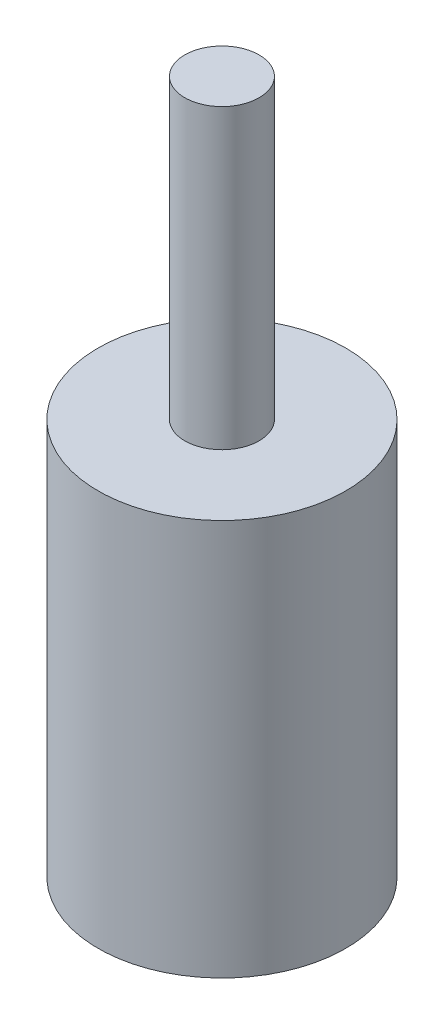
from build123d import *

# Parameters (mm, degrees)
SKETCH3_R           = 1.905
BOSS_EXTRUDE1_DEPTH = 15.24
SKETCH4_R           = 6.35
BOSS_EXTRUDE2_DEPTH = 20.32
CUT_EXTRUDE1_DEPTH  = 15.24


with BuildPart() as part:
    # Sketch3 → Boss-Extrude1 (new body)
    with BuildSketch(Plane(origin=(0, 0, 0), x_dir=(1, 0, 0), z_dir=(0, 1, 0))):
        with Locations(Location((0, 0, 0), (0, 0, 90))):
            Circle(SKETCH3_R)
    extrude(amount=BOSS_EXTRUDE1_DEPTH)

    # Sketch4 → Boss-Extrude2 (add)
    with BuildSketch(Plane.XZ):
        with Locations(Location((0, 0, 0), (0, 0, 270))):
            Circle(SKETCH4_R)
    extrude(amount=BOSS_EXTRUDE2_DEPTH)

    # Sketch5 → Cut-Extrude1 (cut)
    with BuildSketch(Plane.XZ.offset(20.32)):
        with BuildLine():
            Line((-2.365944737, 2.654701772), (1.141305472, 3.367871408))
            ThreePointArc((1.141305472, 3.367871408), (0.708581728, -3.484687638), (-2.365944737, 2.654701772))
        make_face()
    extrude(amount=-CUT_EXTRUDE1_DEPTH, mode=Mode.SUBTRACT)


solid = part.part
